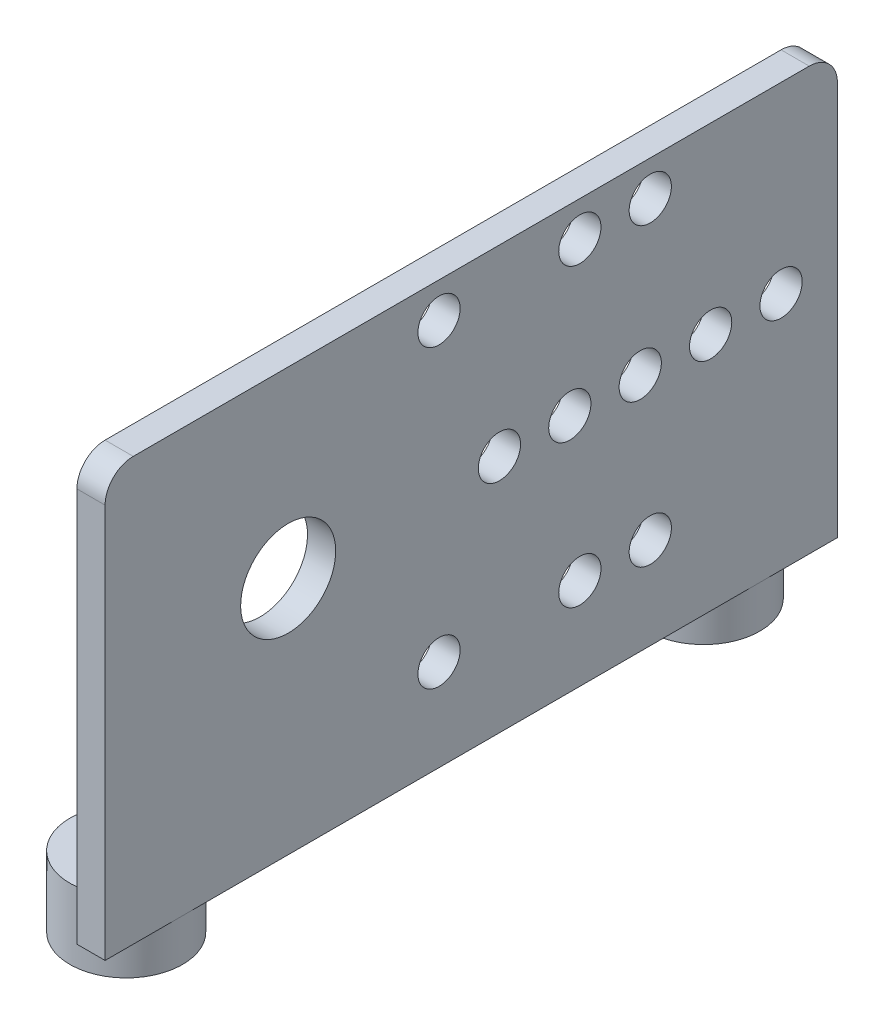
ISO-10303-21;
HEADER;
FILE_DESCRIPTION(('STEP AP214'),'2;1');
FILE_NAME('part.step','',(''),(''),'','','');
FILE_SCHEMA(('AUTOMOTIVE_DESIGN { 1 0 10303 214 1 1 1 1 }'));
ENDSEC;
DATA;
#1=APPLICATION_CONTEXT('core data for automotive mechanical design processes');
#2=APPLICATION_PROTOCOL_DEFINITION('international standard','automotive_design',2000,#1);
#3=PRODUCT_CONTEXT('',#1,'mechanical');
#4=PRODUCT('Part','Part','',(#3));
#5=PRODUCT_RELATED_PRODUCT_CATEGORY('part','',(#4));
#6=PRODUCT_DEFINITION_FORMATION('','',#4);
#7=PRODUCT_DEFINITION_CONTEXT('part definition',#1,'design');
#8=PRODUCT_DEFINITION('design','',#6,#7);
#9=PRODUCT_DEFINITION_SHAPE('','',#8);
#10=(LENGTH_UNIT() NAMED_UNIT(*) SI_UNIT(.MILLI.,.METRE.));
#11=(NAMED_UNIT(*) PLANE_ANGLE_UNIT() SI_UNIT($,.RADIAN.));
#12=(NAMED_UNIT(*) SI_UNIT($,.STERADIAN.) SOLID_ANGLE_UNIT());
#13=UNCERTAINTY_MEASURE_WITH_UNIT(LENGTH_MEASURE(1.E-05),#10,'distance_accuracy_value','');
#14=(GEOMETRIC_REPRESENTATION_CONTEXT(3) GLOBAL_UNCERTAINTY_ASSIGNED_CONTEXT((#13)) GLOBAL_UNIT_ASSIGNED_CONTEXT((#10,
#11,#12)) REPRESENTATION_CONTEXT('',''));
#15=CARTESIAN_POINT('',(0.,0.,0.));
#16=DIRECTION('',(0.,0.,1.));
#17=DIRECTION('',(1.,0.,0.));
#18=AXIS2_PLACEMENT_3D('',#15,#16,#17);
#19=CARTESIAN_POINT('',(0.,0.,-52.));
#20=DIRECTION('',(0.,1.,0.));
#21=DIRECTION('',(0.,0.,-1.));
#22=AXIS2_PLACEMENT_3D('',#19,#20,#21);
#23=PLANE('',#22);
#24=DIRECTION('',(0.,0.,1.));
#25=VECTOR('',#24,1.);
#26=CARTESIAN_POINT('',(0.,0.,-52.));
#27=LINE('',#26,#25);
#28=CARTESIAN_POINT('',(0.,0.,-43.0358983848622));
#29=VERTEX_POINT('',#28);
#30=CARTESIAN_POINT('',(0.,0.,-8.96410161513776));
#31=VERTEX_POINT('',#30);
#32=EDGE_CURVE('E261',#29,#31,#27,.T.);
#33=ORIENTED_EDGE('',*,*,#32,.F.);
#34=CARTESIAN_POINT('',(-2.,0.,-46.5));
#35=DIRECTION('',(0.,1.,0.));
#36=DIRECTION('',(0.,0.,1.));
#37=AXIS2_PLACEMENT_3D('',#34,#35,#36);
#38=CIRCLE('',#37,4.);
#39=CARTESIAN_POINT('',(2.,0.,-46.5));
#40=VERTEX_POINT('',#39);
#41=EDGE_CURVE('E120',#29,#40,#38,.T.);
#42=ORIENTED_EDGE('',*,*,#41,.T.);
#43=DIRECTION('',(0.,0.,1.));
#44=VECTOR('',#43,1.);
#45=CARTESIAN_POINT('',(2.,0.,-52.));
#46=LINE('',#45,#44);
#47=CARTESIAN_POINT('',(2.,0.,-5.50000000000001));
#48=VERTEX_POINT('',#47);
#49=EDGE_CURVE('E167',#40,#48,#46,.T.);
#50=ORIENTED_EDGE('',*,*,#49,.T.);
#51=CARTESIAN_POINT('',(-2.,0.,-5.5));
#52=DIRECTION('',(0.,1.,0.));
#53=DIRECTION('',(0.,0.,1.));
#54=AXIS2_PLACEMENT_3D('',#51,#52,#53);
#55=CIRCLE('',#54,4.);
#56=EDGE_CURVE('E158',#31,#48,#55,.F.);
#57=ORIENTED_EDGE('',*,*,#56,.F.);
#58=EDGE_LOOP('',(#33,#42,#50,#57));
#59=FACE_BOUND('',#58,.T.);
#60=ADVANCED_FACE('F33',(#59),#23,.F.);
#61=CARTESIAN_POINT('',(0.,30.,-52.));
#62=DIRECTION('',(1.,0.,0.));
#63=DIRECTION('',(0.,1.,0.));
#64=AXIS2_PLACEMENT_3D('',#61,#62,#63);
#65=PLANE('',#64);
#66=CARTESIAN_POINT('',(0.,17.,-13.));
#67=DIRECTION('',(1.,0.,0.));
#68=DIRECTION('',(0.,1.,0.));
#69=AXIS2_PLACEMENT_3D('',#66,#67,#68);
#70=CIRCLE('',#69,3.375);
#71=CARTESIAN_POINT('',(0.,20.375,-13.));
#72=VERTEX_POINT('',#71);
#73=EDGE_CURVE('E567',#72,#72,#70,.T.);
#74=ORIENTED_EDGE('',*,*,#73,.T.);
#75=EDGE_LOOP('',(#74));
#76=FACE_BOUND('',#75,.T.);
#77=CARTESIAN_POINT('',(0.,0.,-52.));
#78=VERTEX_POINT('',#77);
#79=CARTESIAN_POINT('',(0.,0.,-49.9641016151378));
#80=VERTEX_POINT('',#79);
#81=EDGE_CURVE('E258',#78,#80,#27,.T.);
#82=ORIENTED_EDGE('',*,*,#81,.T.);
#83=DIRECTION('',(0.,1.,0.));
#84=VECTOR('',#83,1.);
#85=CARTESIAN_POINT('',(0.,-3.,-49.9641016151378));
#86=LINE('',#85,#84);
#87=CARTESIAN_POINT('',(0.,2.,-49.9641016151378));
#88=VERTEX_POINT('',#87);
#89=EDGE_CURVE('E49',#80,#88,#86,.T.);
#90=ORIENTED_EDGE('',*,*,#89,.T.);
#91=DIRECTION('',(0.,0.,-1.));
#92=VECTOR('',#91,1.);
#93=CARTESIAN_POINT('',(0.,2.,-52.));
#94=LINE('',#93,#92);
#95=CARTESIAN_POINT('',(0.,2.,-43.0358983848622));
#96=VERTEX_POINT('',#95);
#97=EDGE_CURVE('E127',#96,#88,#94,.T.);
#98=ORIENTED_EDGE('',*,*,#97,.F.);
#99=DIRECTION('',(0.,1.,0.));
#100=VECTOR('',#99,1.);
#101=CARTESIAN_POINT('',(0.,-3.,-43.0358983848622));
#102=LINE('',#101,#100);
#103=EDGE_CURVE('E115',#96,#29,#102,.F.);
#104=ORIENTED_EDGE('',*,*,#103,.T.);
#105=ORIENTED_EDGE('',*,*,#32,.T.);
#106=DIRECTION('',(0.,1.,0.));
#107=VECTOR('',#106,1.);
#108=CARTESIAN_POINT('',(0.,-3.,-8.96410161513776));
#109=LINE('',#108,#107);
#110=CARTESIAN_POINT('',(0.,2.,-8.96410161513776));
#111=VERTEX_POINT('',#110);
#112=EDGE_CURVE('E57',#111,#31,#109,.F.);
#113=ORIENTED_EDGE('',*,*,#112,.F.);
#114=DIRECTION('',(0.,0.,-1.));
#115=VECTOR('',#114,1.);
#116=CARTESIAN_POINT('',(0.,2.,-52.));
#117=LINE('',#116,#115);
#118=CARTESIAN_POINT('',(0.,2.,-2.03589838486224));
#119=VERTEX_POINT('',#118);
#120=EDGE_CURVE('E150',#119,#111,#117,.T.);
#121=ORIENTED_EDGE('',*,*,#120,.F.);
#122=DIRECTION('',(0.,1.,0.));
#123=VECTOR('',#122,1.);
#124=CARTESIAN_POINT('',(0.,-3.,-2.03589838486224));
#125=LINE('',#124,#123);
#126=CARTESIAN_POINT('',(0.,0.,-2.03589838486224));
#127=VERTEX_POINT('',#126);
#128=EDGE_CURVE('E157',#127,#119,#125,.T.);
#129=ORIENTED_EDGE('',*,*,#128,.F.);
#130=CARTESIAN_POINT('',(0.,0.,0.));
#131=VERTEX_POINT('',#130);
#132=EDGE_CURVE('E257',#127,#131,#27,.T.);
#133=ORIENTED_EDGE('',*,*,#132,.T.);
#134=DIRECTION('',(0.,-1.,0.));
#135=VECTOR('',#134,1.);
#136=CARTESIAN_POINT('',(0.,30.,0.));
#137=LINE('',#136,#135);
#138=CARTESIAN_POINT('',(0.,28.,0.));
#139=VERTEX_POINT('',#138);
#140=EDGE_CURVE('E233',#139,#131,#137,.T.);
#141=ORIENTED_EDGE('',*,*,#140,.F.);
#142=CARTESIAN_POINT('',(0.,28.,-2.));
#143=DIRECTION('',(-1.,0.,0.));
#144=DIRECTION('',(0.,1.,0.));
#145=AXIS2_PLACEMENT_3D('',#142,#143,#144);
#146=CIRCLE('',#145,2.);
#147=CARTESIAN_POINT('',(0.,30.,-2.00000000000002));
#148=VERTEX_POINT('',#147);
#149=EDGE_CURVE('E268',#148,#139,#146,.F.);
#150=ORIENTED_EDGE('',*,*,#149,.F.);
#151=DIRECTION('',(0.,0.,1.));
#152=VECTOR('',#151,1.);
#153=CARTESIAN_POINT('',(0.,30.,-52.));
#154=LINE('',#153,#152);
#155=CARTESIAN_POINT('',(0.,30.,-50.));
#156=VERTEX_POINT('',#155);
#157=EDGE_CURVE('E244',#156,#148,#154,.T.);
#158=ORIENTED_EDGE('',*,*,#157,.F.);
#159=CARTESIAN_POINT('',(0.,28.,-50.));
#160=DIRECTION('',(-1.,0.,0.));
#161=DIRECTION('',(0.,1.,0.));
#162=AXIS2_PLACEMENT_3D('',#159,#160,#161);
#163=CIRCLE('',#162,2.);
#164=CARTESIAN_POINT('',(0.,28.,-52.));
#165=VERTEX_POINT('',#164);
#166=EDGE_CURVE('E265',#165,#156,#163,.F.);
#167=ORIENTED_EDGE('',*,*,#166,.F.);
#168=DIRECTION('',(0.,-1.,0.));
#169=VECTOR('',#168,1.);
#170=CARTESIAN_POINT('',(0.,30.,-52.));
#171=LINE('',#170,#169);
#172=EDGE_CURVE('E234',#165,#78,#171,.T.);
#173=ORIENTED_EDGE('',*,*,#172,.T.);
#174=EDGE_LOOP('',(#82,#90,#98,#104,#105,#113,#121,#129,#133,#141,#150,#158,#167,#173));
#175=FACE_BOUND('',#174,.T.);
#176=CARTESIAN_POINT('',(0.,17.,-43.));
#177=DIRECTION('',(-1.,0.,0.));
#178=DIRECTION('',(0.,1.,0.));
#179=AXIS2_PLACEMENT_3D('',#176,#177,#178);
#180=CIRCLE('',#179,1.5);
#181=CARTESIAN_POINT('',(0.,18.5,-43.));
#182=VERTEX_POINT('',#181);
#183=EDGE_CURVE('E230',#182,#182,#180,.F.);
#184=ORIENTED_EDGE('',*,*,#183,.T.);
#185=EDGE_LOOP('',(#184));
#186=FACE_BOUND('',#185,.T.);
#187=CARTESIAN_POINT('',(0.,17.,-38.));
#188=DIRECTION('',(-1.,0.,0.));
#189=DIRECTION('',(0.,1.,0.));
#190=AXIS2_PLACEMENT_3D('',#187,#188,#189);
#191=CIRCLE('',#190,1.5);
#192=CARTESIAN_POINT('',(0.,18.5,-38.));
#193=VERTEX_POINT('',#192);
#194=EDGE_CURVE('E212',#193,#193,#191,.F.);
#195=ORIENTED_EDGE('',*,*,#194,.T.);
#196=EDGE_LOOP('',(#195));
#197=FACE_BOUND('',#196,.T.);
#198=CARTESIAN_POINT('',(0.,17.,-28.));
#199=DIRECTION('',(-1.,0.,0.));
#200=DIRECTION('',(0.,1.,0.));
#201=AXIS2_PLACEMENT_3D('',#198,#199,#200);
#202=CIRCLE('',#201,1.5);
#203=CARTESIAN_POINT('',(0.,18.5,-28.));
#204=VERTEX_POINT('',#203);
#205=EDGE_CURVE('E201',#204,#204,#202,.F.);
#206=ORIENTED_EDGE('',*,*,#205,.T.);
#207=EDGE_LOOP('',(#206));
#208=FACE_BOUND('',#207,.T.);
#209=CARTESIAN_POINT('',(0.,27.5,-38.7121426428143));
#210=DIRECTION('',(-1.,0.,0.));
#211=DIRECTION('',(0.,1.,0.));
#212=AXIS2_PLACEMENT_3D('',#209,#210,#211);
#213=CIRCLE('',#212,1.5);
#214=CARTESIAN_POINT('',(0.,29.,-38.7121426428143));
#215=VERTEX_POINT('',#214);
#216=EDGE_CURVE('E202',#215,#215,#213,.F.);
#217=ORIENTED_EDGE('',*,*,#216,.T.);
#218=EDGE_LOOP('',(#217));
#219=FACE_BOUND('',#218,.T.);
#220=CARTESIAN_POINT('',(0.,17.,-48.));
#221=DIRECTION('',(-1.,0.,0.));
#222=DIRECTION('',(0.,1.,0.));
#223=AXIS2_PLACEMENT_3D('',#220,#221,#222);
#224=CIRCLE('',#223,1.5);
#225=CARTESIAN_POINT('',(0.,18.5,-48.));
#226=VERTEX_POINT('',#225);
#227=EDGE_CURVE('E220',#226,#226,#224,.F.);
#228=ORIENTED_EDGE('',*,*,#227,.T.);
#229=EDGE_LOOP('',(#228));
#230=FACE_BOUND('',#229,.T.);
#231=CARTESIAN_POINT('',(0.,17.,-33.));
#232=DIRECTION('',(-1.,0.,0.));
#233=DIRECTION('',(0.,1.,0.));
#234=AXIS2_PLACEMENT_3D('',#231,#232,#233);
#235=CIRCLE('',#234,1.5);
#236=CARTESIAN_POINT('',(0.,18.5,-33.));
#237=VERTEX_POINT('',#236);
#238=EDGE_CURVE('E219',#237,#237,#235,.F.);
#239=ORIENTED_EDGE('',*,*,#238,.T.);
#240=EDGE_LOOP('',(#239));
#241=FACE_BOUND('',#240,.T.);
#242=CARTESIAN_POINT('',(0.,6.50000000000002,-23.7121426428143));
#243=DIRECTION('',(-1.,0.,0.));
#244=DIRECTION('',(0.,1.,0.));
#245=AXIS2_PLACEMENT_3D('',#242,#243,#244);
#246=CIRCLE('',#245,1.5);
#247=CARTESIAN_POINT('',(0.,8.00000000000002,-23.7121426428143));
#248=VERTEX_POINT('',#247);
#249=EDGE_CURVE('E179',#248,#248,#246,.F.);
#250=ORIENTED_EDGE('',*,*,#249,.T.);
#251=EDGE_LOOP('',(#250));
#252=FACE_BOUND('',#251,.T.);
#253=CARTESIAN_POINT('',(0.,27.5,-23.7121426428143));
#254=DIRECTION('',(-1.,0.,0.));
#255=DIRECTION('',(0.,1.,0.));
#256=AXIS2_PLACEMENT_3D('',#253,#254,#255);
#257=CIRCLE('',#256,1.5);
#258=CARTESIAN_POINT('',(0.,29.,-23.7121426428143));
#259=VERTEX_POINT('',#258);
#260=EDGE_CURVE('E172',#259,#259,#257,.F.);
#261=ORIENTED_EDGE('',*,*,#260,.T.);
#262=EDGE_LOOP('',(#261));
#263=FACE_BOUND('',#262,.T.);
#264=CARTESIAN_POINT('',(0.,6.50000000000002,-38.7121426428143));
#265=DIRECTION('',(-1.,0.,0.));
#266=DIRECTION('',(0.,1.,0.));
#267=AXIS2_PLACEMENT_3D('',#264,#265,#266);
#268=CIRCLE('',#267,1.5);
#269=CARTESIAN_POINT('',(0.,8.00000000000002,-38.7121426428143));
#270=VERTEX_POINT('',#269);
#271=EDGE_CURVE('E171',#270,#270,#268,.F.);
#272=ORIENTED_EDGE('',*,*,#271,.T.);
#273=EDGE_LOOP('',(#272));
#274=FACE_BOUND('',#273,.T.);
#275=CARTESIAN_POINT('',(0.,6.50000000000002,-33.7121426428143));
#276=DIRECTION('',(-1.,0.,0.));
#277=DIRECTION('',(0.,1.,0.));
#278=AXIS2_PLACEMENT_3D('',#275,#276,#277);
#279=CIRCLE('',#278,1.5);
#280=CARTESIAN_POINT('',(0.,8.00000000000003,-33.7121426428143));
#281=VERTEX_POINT('',#280);
#282=EDGE_CURVE('E190',#281,#281,#279,.F.);
#283=ORIENTED_EDGE('',*,*,#282,.T.);
#284=EDGE_LOOP('',(#283));
#285=FACE_BOUND('',#284,.T.);
#286=CARTESIAN_POINT('',(0.,27.5,-33.7121426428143));
#287=DIRECTION('',(-1.,0.,0.));
#288=DIRECTION('',(0.,1.,0.));
#289=AXIS2_PLACEMENT_3D('',#286,#287,#288);
#290=CIRCLE('',#289,1.5);
#291=CARTESIAN_POINT('',(0.,29.,-33.7121426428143));
#292=VERTEX_POINT('',#291);
#293=EDGE_CURVE('E189',#292,#292,#290,.F.);
#294=ORIENTED_EDGE('',*,*,#293,.T.);
#295=EDGE_LOOP('',(#294));
#296=FACE_BOUND('',#295,.T.);
#297=ADVANCED_FACE('F132',(#76,#175,#186,#197,#208,#219,#230,#241,#252,#263,#274,#285,#296),#65,.F.);
#298=CARTESIAN_POINT('',(2.,0.,-52.));
#299=VERTEX_POINT('',#298);
#300=EDGE_CURVE('E163',#299,#40,#46,.T.);
#301=ORIENTED_EDGE('',*,*,#300,.T.);
#302=EDGE_CURVE('E134',#40,#80,#38,.T.);
#303=ORIENTED_EDGE('',*,*,#302,.T.);
#304=ORIENTED_EDGE('',*,*,#81,.F.);
#305=DIRECTION('',(1.,0.,0.));
#306=VECTOR('',#305,1.);
#307=CARTESIAN_POINT('',(0.,0.,-52.));
#308=LINE('',#307,#306);
#309=EDGE_CURVE('E237',#78,#299,#308,.T.);
#310=ORIENTED_EDGE('',*,*,#309,.T.);
#311=EDGE_LOOP('',(#301,#303,#304,#310));
#312=FACE_BOUND('',#311,.T.);
#313=ADVANCED_FACE('F325',(#312),#23,.F.);
#314=EDGE_CURVE('E154',#48,#127,#55,.F.);
#315=ORIENTED_EDGE('',*,*,#314,.F.);
#316=CARTESIAN_POINT('',(2.,0.,0.));
#317=VERTEX_POINT('',#316);
#318=EDGE_CURVE('E162',#48,#317,#46,.T.);
#319=ORIENTED_EDGE('',*,*,#318,.T.);
#320=DIRECTION('',(1.,0.,0.));
#321=VECTOR('',#320,1.);
#322=CARTESIAN_POINT('',(0.,0.,0.));
#323=LINE('',#322,#321);
#324=EDGE_CURVE('E247',#131,#317,#323,.T.);
#325=ORIENTED_EDGE('',*,*,#324,.F.);
#326=ORIENTED_EDGE('',*,*,#132,.F.);
#327=EDGE_LOOP('',(#315,#319,#325,#326));
#328=FACE_BOUND('',#327,.T.);
#329=ADVANCED_FACE('F306',(#328),#23,.F.);
#330=CARTESIAN_POINT('',(2.,3.,-52.));
#331=DIRECTION('',(-1.,0.,0.));
#332=DIRECTION('',(0.,-1.,0.));
#333=AXIS2_PLACEMENT_3D('',#330,#331,#332);
#334=PLANE('',#333);
#335=CARTESIAN_POINT('',(2.,17.,-13.));
#336=DIRECTION('',(-1.,0.,0.));
#337=DIRECTION('',(0.,-1.,0.));
#338=AXIS2_PLACEMENT_3D('',#335,#336,#337);
#339=CIRCLE('',#338,3.375);
#340=CARTESIAN_POINT('',(2.,20.375,-13.));
#341=VERTEX_POINT('',#340);
#342=EDGE_CURVE('E37',#341,#341,#339,.T.);
#343=ORIENTED_EDGE('',*,*,#342,.T.);
#344=EDGE_LOOP('',(#343));
#345=FACE_BOUND('',#344,.T.);
#346=ORIENTED_EDGE('',*,*,#318,.F.);
#347=ORIENTED_EDGE('',*,*,#49,.F.);
#348=ORIENTED_EDGE('',*,*,#300,.F.);
#349=DIRECTION('',(0.,1.,0.));
#350=VECTOR('',#349,1.);
#351=CARTESIAN_POINT('',(2.,3.,-52.));
#352=LINE('',#351,#350);
#353=CARTESIAN_POINT('',(2.,28.,-52.));
#354=VERTEX_POINT('',#353);
#355=EDGE_CURVE('E241',#299,#354,#352,.T.);
#356=ORIENTED_EDGE('',*,*,#355,.T.);
#357=CARTESIAN_POINT('',(2.,28.,-50.));
#358=DIRECTION('',(1.,0.,0.));
#359=DIRECTION('',(0.,-1.,0.));
#360=AXIS2_PLACEMENT_3D('',#357,#358,#359);
#361=CIRCLE('',#360,2.);
#362=CARTESIAN_POINT('',(2.,30.,-50.));
#363=VERTEX_POINT('',#362);
#364=EDGE_CURVE('E273',#363,#354,#361,.F.);
#365=ORIENTED_EDGE('',*,*,#364,.F.);
#366=DIRECTION('',(0.,0.,1.));
#367=VECTOR('',#366,1.);
#368=CARTESIAN_POINT('',(2.,30.,-52.));
#369=LINE('',#368,#367);
#370=CARTESIAN_POINT('',(2.,30.,-2.00000000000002));
#371=VERTEX_POINT('',#370);
#372=EDGE_CURVE('E254',#363,#371,#369,.T.);
#373=ORIENTED_EDGE('',*,*,#372,.T.);
#374=CARTESIAN_POINT('',(2.,28.,-2.));
#375=DIRECTION('',(1.,0.,0.));
#376=DIRECTION('',(0.,-1.,0.));
#377=AXIS2_PLACEMENT_3D('',#374,#375,#376);
#378=CIRCLE('',#377,2.);
#379=CARTESIAN_POINT('',(2.,28.,0.));
#380=VERTEX_POINT('',#379);
#381=EDGE_CURVE('E42',#380,#371,#378,.F.);
#382=ORIENTED_EDGE('',*,*,#381,.F.);
#383=DIRECTION('',(0.,1.,0.));
#384=VECTOR('',#383,1.);
#385=CARTESIAN_POINT('',(2.,3.,0.));
#386=LINE('',#385,#384);
#387=EDGE_CURVE('E238',#317,#380,#386,.T.);
#388=ORIENTED_EDGE('',*,*,#387,.F.);
#389=EDGE_LOOP('',(#346,#347,#348,#356,#365,#373,#382,#388));
#390=FACE_BOUND('',#389,.T.);
#391=CARTESIAN_POINT('',(2.,27.5,-33.7121426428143));
#392=DIRECTION('',(-1.,0.,0.));
#393=DIRECTION('',(0.,1.,0.));
#394=AXIS2_PLACEMENT_3D('',#391,#392,#393);
#395=CIRCLE('',#394,1.5);
#396=CARTESIAN_POINT('',(2.,29.,-33.7121426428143));
#397=VERTEX_POINT('',#396);
#398=EDGE_CURVE('E186',#397,#397,#395,.T.);
#399=ORIENTED_EDGE('',*,*,#398,.T.);
#400=EDGE_LOOP('',(#399));
#401=FACE_BOUND('',#400,.T.);
#402=CARTESIAN_POINT('',(2.,6.50000000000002,-33.7121426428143));
#403=DIRECTION('',(-1.,0.,0.));
#404=DIRECTION('',(0.,-1.,0.));
#405=AXIS2_PLACEMENT_3D('',#402,#403,#404);
#406=CIRCLE('',#405,1.5);
#407=CARTESIAN_POINT('',(2.,5.00000000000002,-33.7121426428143));
#408=VERTEX_POINT('',#407);
#409=EDGE_CURVE('E175',#408,#408,#406,.T.);
#410=ORIENTED_EDGE('',*,*,#409,.T.);
#411=EDGE_LOOP('',(#410));
#412=FACE_BOUND('',#411,.T.);
#413=CARTESIAN_POINT('',(2.,6.50000000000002,-38.7121426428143));
#414=DIRECTION('',(-1.,0.,0.));
#415=DIRECTION('',(0.,-1.,0.));
#416=AXIS2_PLACEMENT_3D('',#413,#414,#415);
#417=CIRCLE('',#416,1.5);
#418=CARTESIAN_POINT('',(2.,5.00000000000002,-38.7121426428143));
#419=VERTEX_POINT('',#418);
#420=EDGE_CURVE('E168',#419,#419,#417,.T.);
#421=ORIENTED_EDGE('',*,*,#420,.T.);
#422=EDGE_LOOP('',(#421));
#423=FACE_BOUND('',#422,.T.);
#424=CARTESIAN_POINT('',(2.,27.5,-23.7121426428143));
#425=DIRECTION('',(-1.,0.,0.));
#426=DIRECTION('',(0.,-1.,0.));
#427=AXIS2_PLACEMENT_3D('',#424,#425,#426);
#428=CIRCLE('',#427,1.5);
#429=CARTESIAN_POINT('',(2.,26.,-23.7121426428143));
#430=VERTEX_POINT('',#429);
#431=EDGE_CURVE('E176',#430,#430,#428,.T.);
#432=ORIENTED_EDGE('',*,*,#431,.T.);
#433=EDGE_LOOP('',(#432));
#434=FACE_BOUND('',#433,.T.);
#435=CARTESIAN_POINT('',(2.,6.50000000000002,-23.7121426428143));
#436=DIRECTION('',(-1.,0.,0.));
#437=DIRECTION('',(0.,1.,0.));
#438=AXIS2_PLACEMENT_3D('',#435,#436,#437);
#439=CIRCLE('',#438,1.5);
#440=CARTESIAN_POINT('',(2.,8.00000000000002,-23.7121426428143));
#441=VERTEX_POINT('',#440);
#442=EDGE_CURVE('E166',#441,#441,#439,.T.);
#443=ORIENTED_EDGE('',*,*,#442,.T.);
#444=EDGE_LOOP('',(#443));
#445=FACE_BOUND('',#444,.T.);
#446=CARTESIAN_POINT('',(2.,17.,-33.));
#447=DIRECTION('',(-1.,0.,0.));
#448=DIRECTION('',(0.,1.,0.));
#449=AXIS2_PLACEMENT_3D('',#446,#447,#448);
#450=CIRCLE('',#449,1.5);
#451=CARTESIAN_POINT('',(2.,18.5,-33.));
#452=VERTEX_POINT('',#451);
#453=EDGE_CURVE('E216',#452,#452,#450,.T.);
#454=ORIENTED_EDGE('',*,*,#453,.T.);
#455=EDGE_LOOP('',(#454));
#456=FACE_BOUND('',#455,.T.);
#457=CARTESIAN_POINT('',(2.,17.,-48.));
#458=DIRECTION('',(-1.,0.,0.));
#459=DIRECTION('',(0.,1.,0.));
#460=AXIS2_PLACEMENT_3D('',#457,#458,#459);
#461=CIRCLE('',#460,1.5);
#462=CARTESIAN_POINT('',(2.,18.5,-48.));
#463=VERTEX_POINT('',#462);
#464=EDGE_CURVE('E215',#463,#463,#461,.T.);
#465=ORIENTED_EDGE('',*,*,#464,.T.);
#466=EDGE_LOOP('',(#465));
#467=FACE_BOUND('',#466,.T.);
#468=CARTESIAN_POINT('',(2.,27.5,-38.7121426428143));
#469=DIRECTION('',(-1.,0.,0.));
#470=DIRECTION('',(0.,1.,0.));
#471=AXIS2_PLACEMENT_3D('',#468,#469,#470);
#472=CIRCLE('',#471,1.5);
#473=CARTESIAN_POINT('',(2.,29.,-38.7121426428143));
#474=VERTEX_POINT('',#473);
#475=EDGE_CURVE('E193',#474,#474,#472,.T.);
#476=ORIENTED_EDGE('',*,*,#475,.T.);
#477=EDGE_LOOP('',(#476));
#478=FACE_BOUND('',#477,.T.);
#479=CARTESIAN_POINT('',(2.,17.,-28.));
#480=DIRECTION('',(-1.,0.,0.));
#481=DIRECTION('',(0.,1.,0.));
#482=AXIS2_PLACEMENT_3D('',#479,#480,#481);
#483=CIRCLE('',#482,1.5);
#484=CARTESIAN_POINT('',(2.,18.5,-28.));
#485=VERTEX_POINT('',#484);
#486=EDGE_CURVE('E198',#485,#485,#483,.T.);
#487=ORIENTED_EDGE('',*,*,#486,.T.);
#488=EDGE_LOOP('',(#487));
#489=FACE_BOUND('',#488,.T.);
#490=CARTESIAN_POINT('',(2.,17.,-38.));
#491=DIRECTION('',(-1.,0.,0.));
#492=DIRECTION('',(0.,1.,0.));
#493=AXIS2_PLACEMENT_3D('',#490,#491,#492);
#494=CIRCLE('',#493,1.5);
#495=CARTESIAN_POINT('',(2.,18.5,-38.));
#496=VERTEX_POINT('',#495);
#497=EDGE_CURVE('E205',#496,#496,#494,.T.);
#498=ORIENTED_EDGE('',*,*,#497,.T.);
#499=EDGE_LOOP('',(#498));
#500=FACE_BOUND('',#499,.T.);
#501=CARTESIAN_POINT('',(2.,17.,-43.));
#502=DIRECTION('',(-1.,0.,0.));
#503=DIRECTION('',(0.,1.,0.));
#504=AXIS2_PLACEMENT_3D('',#501,#502,#503);
#505=CIRCLE('',#504,1.5);
#506=CARTESIAN_POINT('',(2.,18.5,-43.));
#507=VERTEX_POINT('',#506);
#508=EDGE_CURVE('E223',#507,#507,#505,.T.);
#509=ORIENTED_EDGE('',*,*,#508,.T.);
#510=EDGE_LOOP('',(#509));
#511=FACE_BOUND('',#510,.T.);
#512=ADVANCED_FACE('F286',(#345,#390,#401,#412,#423,#434,#445,#456,#467,#478,#489,#500,#511),
#334,.F.);
#513=CARTESIAN_POINT('',(2.,30.,-52.));
#514=DIRECTION('',(0.,-1.,0.));
#515=DIRECTION('',(0.,0.,1.));
#516=AXIS2_PLACEMENT_3D('',#513,#514,#515);
#517=PLANE('',#516);
#518=ORIENTED_EDGE('',*,*,#372,.F.);
#519=DIRECTION('',(-1.,0.,0.));
#520=VECTOR('',#519,1.);
#521=CARTESIAN_POINT('',(2.,30.,-50.));
#522=LINE('',#521,#520);
#523=EDGE_CURVE('E260',#156,#363,#522,.F.);
#524=ORIENTED_EDGE('',*,*,#523,.F.);
#525=ORIENTED_EDGE('',*,*,#157,.T.);
#526=DIRECTION('',(-1.,0.,0.));
#527=VECTOR('',#526,1.);
#528=CARTESIAN_POINT('',(2.,30.,-2.));
#529=LINE('',#528,#527);
#530=EDGE_CURVE('E263',#371,#148,#529,.T.);
#531=ORIENTED_EDGE('',*,*,#530,.F.);
#532=EDGE_LOOP('',(#518,#524,#525,#531));
#533=FACE_BOUND('',#532,.T.);
#534=ADVANCED_FACE('F289',(#533),#517,.F.);
#535=CARTESIAN_POINT('',(0.,0.,-52.));
#536=DIRECTION('',(0.,0.,-1.));
#537=DIRECTION('',(1.,0.,0.));
#538=AXIS2_PLACEMENT_3D('',#535,#536,#537);
#539=PLANE('',#538);
#540=ORIENTED_EDGE('',*,*,#355,.F.);
#541=ORIENTED_EDGE('',*,*,#309,.F.);
#542=ORIENTED_EDGE('',*,*,#172,.F.);
#543=DIRECTION('',(-1.,0.,0.));
#544=VECTOR('',#543,1.);
#545=CARTESIAN_POINT('',(0.,28.,-52.));
#546=LINE('',#545,#544);
#547=EDGE_CURVE('E11',#354,#165,#546,.T.);
#548=ORIENTED_EDGE('',*,*,#547,.F.);
#549=EDGE_LOOP('',(#540,#541,#542,#548));
#550=FACE_BOUND('',#549,.T.);
#551=ADVANCED_FACE('F342',(#550),#539,.T.);
#552=CARTESIAN_POINT('',(0.,0.,0.));
#553=DIRECTION('',(0.,0.,-1.));
#554=DIRECTION('',(1.,0.,0.));
#555=AXIS2_PLACEMENT_3D('',#552,#553,#554);
#556=PLANE('',#555);
#557=ORIENTED_EDGE('',*,*,#324,.T.);
#558=ORIENTED_EDGE('',*,*,#387,.T.);
#559=DIRECTION('',(-1.,0.,0.));
#560=VECTOR('',#559,1.);
#561=CARTESIAN_POINT('',(0.,28.,0.));
#562=LINE('',#561,#560);
#563=EDGE_CURVE('E271',#139,#380,#562,.F.);
#564=ORIENTED_EDGE('',*,*,#563,.F.);
#565=ORIENTED_EDGE('',*,*,#140,.T.);
#566=EDGE_LOOP('',(#557,#558,#564,#565));
#567=FACE_BOUND('',#566,.T.);
#568=ADVANCED_FACE('F296',(#567),#556,.F.);
#569=CARTESIAN_POINT('',(2.,28.,-2.));
#570=DIRECTION('',(-1.,0.,0.));
#571=DIRECTION('',(0.,0.,-1.));
#572=AXIS2_PLACEMENT_3D('',#569,#570,#571);
#573=CYLINDRICAL_SURFACE('',#572,2.);
#574=ORIENTED_EDGE('',*,*,#381,.T.);
#575=ORIENTED_EDGE('',*,*,#530,.T.);
#576=ORIENTED_EDGE('',*,*,#149,.T.);
#577=ORIENTED_EDGE('',*,*,#563,.T.);
#578=EDGE_LOOP('',(#574,#575,#576,#577));
#579=FACE_BOUND('',#578,.T.);
#580=ADVANCED_FACE('F279',(#579),#573,.T.);
#581=CARTESIAN_POINT('',(0.,28.,-50.));
#582=DIRECTION('',(1.,0.,0.));
#583=DIRECTION('',(0.,0.,1.));
#584=AXIS2_PLACEMENT_3D('',#581,#582,#583);
#585=CYLINDRICAL_SURFACE('',#584,2.);
#586=ORIENTED_EDGE('',*,*,#364,.T.);
#587=ORIENTED_EDGE('',*,*,#547,.T.);
#588=ORIENTED_EDGE('',*,*,#166,.T.);
#589=ORIENTED_EDGE('',*,*,#523,.T.);
#590=EDGE_LOOP('',(#586,#587,#588,#589));
#591=FACE_BOUND('',#590,.T.);
#592=ADVANCED_FACE('F35',(#591),#585,.T.);
#593=CARTESIAN_POINT('',(-4.24264068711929,17.,-43.));
#594=DIRECTION('',(1.,0.,0.));
#595=DIRECTION('',(0.,1.,0.));
#596=AXIS2_PLACEMENT_3D('',#593,#594,#595);
#597=CYLINDRICAL_SURFACE('',#596,1.5);
#598=ORIENTED_EDGE('',*,*,#183,.F.);
#599=EDGE_LOOP('',(#598));
#600=FACE_BOUND('',#599,.T.);
#601=ORIENTED_EDGE('',*,*,#508,.F.);
#602=EDGE_LOOP('',(#601));
#603=FACE_BOUND('',#602,.T.);
#604=ADVANCED_FACE('F351',(#600,#603),#597,.F.);
#605=CARTESIAN_POINT('',(-4.24264068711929,17.,-38.));
#606=DIRECTION('',(1.,0.,0.));
#607=DIRECTION('',(0.,1.,0.));
#608=AXIS2_PLACEMENT_3D('',#605,#606,#607);
#609=CYLINDRICAL_SURFACE('',#608,1.5);
#610=ORIENTED_EDGE('',*,*,#194,.F.);
#611=EDGE_LOOP('',(#610));
#612=FACE_BOUND('',#611,.T.);
#613=ORIENTED_EDGE('',*,*,#497,.F.);
#614=EDGE_LOOP('',(#613));
#615=FACE_BOUND('',#614,.T.);
#616=ADVANCED_FACE('F354',(#612,#615),#609,.F.);
#617=CARTESIAN_POINT('',(-4.24264068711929,17.,-28.));
#618=DIRECTION('',(1.,0.,0.));
#619=DIRECTION('',(0.,1.,0.));
#620=AXIS2_PLACEMENT_3D('',#617,#618,#619);
#621=CYLINDRICAL_SURFACE('',#620,1.5);
#622=ORIENTED_EDGE('',*,*,#205,.F.);
#623=EDGE_LOOP('',(#622));
#624=FACE_BOUND('',#623,.T.);
#625=ORIENTED_EDGE('',*,*,#486,.F.);
#626=EDGE_LOOP('',(#625));
#627=FACE_BOUND('',#626,.T.);
#628=ADVANCED_FACE('F368',(#624,#627),#621,.F.);
#629=CARTESIAN_POINT('',(-4.24264068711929,27.5,-38.7121426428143));
#630=DIRECTION('',(1.,0.,0.));
#631=DIRECTION('',(0.,1.,0.));
#632=AXIS2_PLACEMENT_3D('',#629,#630,#631);
#633=CYLINDRICAL_SURFACE('',#632,1.5);
#634=ORIENTED_EDGE('',*,*,#216,.F.);
#635=EDGE_LOOP('',(#634));
#636=FACE_BOUND('',#635,.T.);
#637=ORIENTED_EDGE('',*,*,#475,.F.);
#638=EDGE_LOOP('',(#637));
#639=FACE_BOUND('',#638,.T.);
#640=ADVANCED_FACE('F360',(#636,#639),#633,.F.);
#641=CARTESIAN_POINT('',(-4.24264068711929,17.,-48.));
#642=DIRECTION('',(1.,0.,0.));
#643=DIRECTION('',(0.,1.,0.));
#644=AXIS2_PLACEMENT_3D('',#641,#642,#643);
#645=CYLINDRICAL_SURFACE('',#644,1.5);
#646=ORIENTED_EDGE('',*,*,#227,.F.);
#647=EDGE_LOOP('',(#646));
#648=FACE_BOUND('',#647,.T.);
#649=ORIENTED_EDGE('',*,*,#464,.F.);
#650=EDGE_LOOP('',(#649));
#651=FACE_BOUND('',#650,.T.);
#652=ADVANCED_FACE('F356',(#648,#651),#645,.F.);
#653=CARTESIAN_POINT('',(-4.24264068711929,17.,-33.));
#654=DIRECTION('',(1.,0.,0.));
#655=DIRECTION('',(0.,1.,0.));
#656=AXIS2_PLACEMENT_3D('',#653,#654,#655);
#657=CYLINDRICAL_SURFACE('',#656,1.5);
#658=ORIENTED_EDGE('',*,*,#238,.F.);
#659=EDGE_LOOP('',(#658));
#660=FACE_BOUND('',#659,.T.);
#661=ORIENTED_EDGE('',*,*,#453,.F.);
#662=EDGE_LOOP('',(#661));
#663=FACE_BOUND('',#662,.T.);
#664=ADVANCED_FACE('F359',(#660,#663),#657,.F.);
#665=CARTESIAN_POINT('',(-4.24264068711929,6.50000000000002,-23.7121426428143));
#666=DIRECTION('',(1.,0.,0.));
#667=DIRECTION('',(0.,1.,0.));
#668=AXIS2_PLACEMENT_3D('',#665,#666,#667);
#669=CYLINDRICAL_SURFACE('',#668,1.5);
#670=ORIENTED_EDGE('',*,*,#249,.F.);
#671=EDGE_LOOP('',(#670));
#672=FACE_BOUND('',#671,.T.);
#673=ORIENTED_EDGE('',*,*,#442,.F.);
#674=EDGE_LOOP('',(#673));
#675=FACE_BOUND('',#674,.T.);
#676=ADVANCED_FACE('F364',(#672,#675),#669,.F.);
#677=CARTESIAN_POINT('',(-4.24264068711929,27.5,-23.7121426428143));
#678=DIRECTION('',(1.,0.,0.));
#679=DIRECTION('',(0.,1.,0.));
#680=AXIS2_PLACEMENT_3D('',#677,#678,#679);
#681=CYLINDRICAL_SURFACE('',#680,1.5);
#682=ORIENTED_EDGE('',*,*,#260,.F.);
#683=EDGE_LOOP('',(#682));
#684=FACE_BOUND('',#683,.T.);
#685=ORIENTED_EDGE('',*,*,#431,.F.);
#686=EDGE_LOOP('',(#685));
#687=FACE_BOUND('',#686,.T.);
#688=ADVANCED_FACE('F386',(#684,#687),#681,.F.);
#689=CARTESIAN_POINT('',(-4.24264068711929,6.50000000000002,-38.7121426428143));
#690=DIRECTION('',(1.,0.,0.));
#691=DIRECTION('',(0.,1.,0.));
#692=AXIS2_PLACEMENT_3D('',#689,#690,#691);
#693=CYLINDRICAL_SURFACE('',#692,1.5);
#694=ORIENTED_EDGE('',*,*,#271,.F.);
#695=EDGE_LOOP('',(#694));
#696=FACE_BOUND('',#695,.T.);
#697=ORIENTED_EDGE('',*,*,#420,.F.);
#698=EDGE_LOOP('',(#697));
#699=FACE_BOUND('',#698,.T.);
#700=ADVANCED_FACE('F379',(#696,#699),#693,.F.);
#701=CARTESIAN_POINT('',(-4.24264068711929,6.50000000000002,-33.7121426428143));
#702=DIRECTION('',(1.,0.,0.));
#703=DIRECTION('',(0.,1.,0.));
#704=AXIS2_PLACEMENT_3D('',#701,#702,#703);
#705=CYLINDRICAL_SURFACE('',#704,1.5);
#706=ORIENTED_EDGE('',*,*,#282,.F.);
#707=EDGE_LOOP('',(#706));
#708=FACE_BOUND('',#707,.T.);
#709=ORIENTED_EDGE('',*,*,#409,.F.);
#710=EDGE_LOOP('',(#709));
#711=FACE_BOUND('',#710,.T.);
#712=ADVANCED_FACE('F376',(#708,#711),#705,.F.);
#713=CARTESIAN_POINT('',(-4.24264068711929,27.5,-33.7121426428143));
#714=DIRECTION('',(1.,0.,0.));
#715=DIRECTION('',(0.,1.,0.));
#716=AXIS2_PLACEMENT_3D('',#713,#714,#715);
#717=CYLINDRICAL_SURFACE('',#716,1.5);
#718=ORIENTED_EDGE('',*,*,#293,.F.);
#719=EDGE_LOOP('',(#718));
#720=FACE_BOUND('',#719,.T.);
#721=ORIENTED_EDGE('',*,*,#398,.F.);
#722=EDGE_LOOP('',(#721));
#723=FACE_BOUND('',#722,.T.);
#724=ADVANCED_FACE('F320',(#720,#723),#717,.F.);
#725=CARTESIAN_POINT('',(-2.,-3.,-5.5));
#726=DIRECTION('',(0.,1.,0.));
#727=DIRECTION('',(0.,0.,1.));
#728=AXIS2_PLACEMENT_3D('',#725,#726,#727);
#729=CYLINDRICAL_SURFACE('',#728,4.);
#730=CARTESIAN_POINT('',(-2.,-3.,-5.5));
#731=DIRECTION('',(0.,-1.,0.));
#732=DIRECTION('',(0.,0.,-1.));
#733=AXIS2_PLACEMENT_3D('',#730,#731,#732);
#734=CIRCLE('',#733,4.);
#735=CARTESIAN_POINT('',(-2.,-3.,-9.5));
#736=VERTEX_POINT('',#735);
#737=EDGE_CURVE('E147',#736,#736,#734,.T.);
#738=ORIENTED_EDGE('',*,*,#737,.F.);
#739=EDGE_LOOP('',(#738));
#740=FACE_BOUND('',#739,.T.);
#741=CARTESIAN_POINT('',(-2.,2.,-5.5));
#742=DIRECTION('',(0.,-1.,0.));
#743=DIRECTION('',(0.,0.,-1.));
#744=AXIS2_PLACEMENT_3D('',#741,#742,#743);
#745=CIRCLE('',#744,4.);
#746=EDGE_CURVE('E144',#119,#111,#745,.T.);
#747=ORIENTED_EDGE('',*,*,#746,.T.);
#748=ORIENTED_EDGE('',*,*,#112,.T.);
#749=ORIENTED_EDGE('',*,*,#56,.T.);
#750=ORIENTED_EDGE('',*,*,#314,.T.);
#751=ORIENTED_EDGE('',*,*,#128,.T.);
#752=EDGE_LOOP('',(#747,#748,#749,#750,#751));
#753=FACE_BOUND('',#752,.T.);
#754=ADVANCED_FACE('F304',(#740,#753),#729,.T.);
#755=CARTESIAN_POINT('',(-2.,2.,-5.5));
#756=DIRECTION('',(0.,-1.,0.));
#757=DIRECTION('',(0.,0.,-1.));
#758=AXIS2_PLACEMENT_3D('',#755,#756,#757);
#759=PLANE('',#758);
#760=ORIENTED_EDGE('',*,*,#746,.F.);
#761=ORIENTED_EDGE('',*,*,#120,.T.);
#762=EDGE_LOOP('',(#760,#761));
#763=FACE_BOUND('',#762,.T.);
#764=ADVANCED_FACE('F309',(#763),#759,.F.);
#765=CARTESIAN_POINT('',(-2.,-3.,-5.5));
#766=DIRECTION('',(0.,-1.,0.));
#767=DIRECTION('',(0.,0.,-1.));
#768=AXIS2_PLACEMENT_3D('',#765,#766,#767);
#769=PLANE('',#768);
#770=CARTESIAN_POINT('',(-2.,-3.,-5.5));
#771=DIRECTION('',(0.,-1.,0.));
#772=DIRECTION('',(0.,0.,-1.));
#773=AXIS2_PLACEMENT_3D('',#770,#771,#772);
#774=CIRCLE('',#773,3.25);
#775=CARTESIAN_POINT('',(-2.,-3.,-8.75));
#776=VERTEX_POINT('',#775);
#777=EDGE_CURVE('E123',#776,#776,#774,.T.);
#778=ORIENTED_EDGE('',*,*,#777,.F.);
#779=EDGE_LOOP('',(#778));
#780=FACE_BOUND('',#779,.T.);
#781=ORIENTED_EDGE('',*,*,#737,.T.);
#782=EDGE_LOOP('',(#781));
#783=FACE_BOUND('',#782,.T.);
#784=ADVANCED_FACE('F311',(#780,#783),#769,.T.);
#785=CARTESIAN_POINT('',(-2.,0.,-5.5));
#786=DIRECTION('',(0.,-1.,0.));
#787=DIRECTION('',(0.,0.,-1.));
#788=AXIS2_PLACEMENT_3D('',#785,#786,#787);
#789=CYLINDRICAL_SURFACE('',#788,3.25);
#790=CARTESIAN_POINT('',(-2.,0.,-5.5));
#791=DIRECTION('',(0.,-1.,0.));
#792=DIRECTION('',(0.,0.,-1.));
#793=AXIS2_PLACEMENT_3D('',#790,#791,#792);
#794=CIRCLE('',#793,3.25);
#795=CARTESIAN_POINT('',(-2.,0.,-8.75));
#796=VERTEX_POINT('',#795);
#797=EDGE_CURVE('E141',#796,#796,#794,.T.);
#798=ORIENTED_EDGE('',*,*,#797,.F.);
#799=EDGE_LOOP('',(#798));
#800=FACE_BOUND('',#799,.T.);
#801=ORIENTED_EDGE('',*,*,#777,.T.);
#802=EDGE_LOOP('',(#801));
#803=FACE_BOUND('',#802,.T.);
#804=ADVANCED_FACE('F317',(#800,#803),#789,.F.);
#805=CARTESIAN_POINT('',(-2.,0.,-5.5));
#806=DIRECTION('',(0.,-1.,0.));
#807=DIRECTION('',(0.,0.,-1.));
#808=AXIS2_PLACEMENT_3D('',#805,#806,#807);
#809=PLANE('',#808);
#810=ORIENTED_EDGE('',*,*,#797,.T.);
#811=EDGE_LOOP('',(#810));
#812=FACE_BOUND('',#811,.T.);
#813=ADVANCED_FACE('F471',(#812),#809,.T.);
#814=CARTESIAN_POINT('',(-2.,-3.,-46.5));
#815=DIRECTION('',(0.,1.,0.));
#816=DIRECTION('',(0.,0.,1.));
#817=AXIS2_PLACEMENT_3D('',#814,#815,#816);
#818=CYLINDRICAL_SURFACE('',#817,4.);
#819=CARTESIAN_POINT('',(-2.,-3.,-46.5));
#820=DIRECTION('',(0.,1.,0.));
#821=DIRECTION('',(0.,0.,1.));
#822=AXIS2_PLACEMENT_3D('',#819,#820,#821);
#823=CIRCLE('',#822,4.);
#824=CARTESIAN_POINT('',(-2.,-3.,-42.5));
#825=VERTEX_POINT('',#824);
#826=EDGE_CURVE('E128',#825,#825,#823,.T.);
#827=ORIENTED_EDGE('',*,*,#826,.T.);
#828=EDGE_LOOP('',(#827));
#829=FACE_BOUND('',#828,.T.);
#830=ORIENTED_EDGE('',*,*,#103,.F.);
#831=CARTESIAN_POINT('',(-2.,2.,-46.5));
#832=DIRECTION('',(0.,1.,0.));
#833=DIRECTION('',(0.,0.,1.));
#834=AXIS2_PLACEMENT_3D('',#831,#832,#833);
#835=CIRCLE('',#834,4.);
#836=EDGE_CURVE('E118',#88,#96,#835,.T.);
#837=ORIENTED_EDGE('',*,*,#836,.F.);
#838=ORIENTED_EDGE('',*,*,#89,.F.);
#839=ORIENTED_EDGE('',*,*,#302,.F.);
#840=ORIENTED_EDGE('',*,*,#41,.F.);
#841=EDGE_LOOP('',(#830,#837,#838,#839,#840));
#842=FACE_BOUND('',#841,.T.);
#843=ADVANCED_FACE('F117',(#829,#842),#818,.T.);
#844=CARTESIAN_POINT('',(-2.,2.,-46.5));
#845=DIRECTION('',(0.,-1.,0.));
#846=DIRECTION('',(0.,0.,1.));
#847=AXIS2_PLACEMENT_3D('',#844,#845,#846);
#848=PLANE('',#847);
#849=ORIENTED_EDGE('',*,*,#836,.T.);
#850=ORIENTED_EDGE('',*,*,#97,.T.);
#851=EDGE_LOOP('',(#849,#850));
#852=FACE_BOUND('',#851,.T.);
#853=ADVANCED_FACE('F126',(#852),#848,.F.);
#854=CARTESIAN_POINT('',(-2.,-3.,-46.5));
#855=DIRECTION('',(0.,-1.,0.));
#856=DIRECTION('',(0.,0.,1.));
#857=AXIS2_PLACEMENT_3D('',#854,#855,#856);
#858=PLANE('',#857);
#859=CARTESIAN_POINT('',(-2.,-3.,-46.5));
#860=DIRECTION('',(0.,1.,0.));
#861=DIRECTION('',(0.,0.,1.));
#862=AXIS2_PLACEMENT_3D('',#859,#860,#861);
#863=CIRCLE('',#862,3.25);
#864=CARTESIAN_POINT('',(-2.,-3.,-43.25));
#865=VERTEX_POINT('',#864);
#866=EDGE_CURVE('E568',#865,#865,#863,.T.);
#867=ORIENTED_EDGE('',*,*,#866,.T.);
#868=EDGE_LOOP('',(#867));
#869=FACE_BOUND('',#868,.T.);
#870=ORIENTED_EDGE('',*,*,#826,.F.);
#871=EDGE_LOOP('',(#870));
#872=FACE_BOUND('',#871,.T.);
#873=ADVANCED_FACE('F510',(#869,#872),#858,.T.);
#874=CARTESIAN_POINT('',(-2.,0.,-46.5));
#875=DIRECTION('',(0.,-1.,0.));
#876=DIRECTION('',(0.,0.,-1.));
#877=AXIS2_PLACEMENT_3D('',#874,#875,#876);
#878=CYLINDRICAL_SURFACE('',#877,3.25);
#879=CARTESIAN_POINT('',(-2.,0.,-46.5));
#880=DIRECTION('',(0.,1.,0.));
#881=DIRECTION('',(0.,0.,1.));
#882=AXIS2_PLACEMENT_3D('',#879,#880,#881);
#883=CIRCLE('',#882,3.25);
#884=CARTESIAN_POINT('',(-2.,0.,-43.25));
#885=VERTEX_POINT('',#884);
#886=EDGE_CURVE('E129',#885,#885,#883,.T.);
#887=ORIENTED_EDGE('',*,*,#886,.T.);
#888=EDGE_LOOP('',(#887));
#889=FACE_BOUND('',#888,.T.);
#890=ORIENTED_EDGE('',*,*,#866,.F.);
#891=EDGE_LOOP('',(#890));
#892=FACE_BOUND('',#891,.T.);
#893=ADVANCED_FACE('F519',(#889,#892),#878,.F.);
#894=CARTESIAN_POINT('',(-2.,0.,-46.5));
#895=DIRECTION('',(0.,-1.,0.));
#896=DIRECTION('',(0.,0.,1.));
#897=AXIS2_PLACEMENT_3D('',#894,#895,#896);
#898=PLANE('',#897);
#899=ORIENTED_EDGE('',*,*,#886,.F.);
#900=EDGE_LOOP('',(#899));
#901=FACE_BOUND('',#900,.T.);
#902=ADVANCED_FACE('F529',(#901),#898,.T.);
#903=CARTESIAN_POINT('',(-6.,17.,-13.));
#904=DIRECTION('',(1.,0.,0.));
#905=DIRECTION('',(0.,1.,0.));
#906=AXIS2_PLACEMENT_3D('',#903,#904,#905);
#907=CYLINDRICAL_SURFACE('',#906,3.375);
#908=CARTESIAN_POINT('',(2.,20.375,-13.));
#909=CARTESIAN_POINT('',(1.97916666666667,20.375,-13.));
#910=CARTESIAN_POINT('',(1.95833333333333,20.375,-13.));
#911=CARTESIAN_POINT('',(1.91666666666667,20.375,-13.));
#912=CARTESIAN_POINT('',(1.89583333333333,20.375,-13.));
#913=CARTESIAN_POINT('',(1.85416666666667,20.375,-13.));
#914=CARTESIAN_POINT('',(1.83333333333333,20.375,-13.));
#915=CARTESIAN_POINT('',(1.79166666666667,20.375,-13.));
#916=CARTESIAN_POINT('',(1.77083333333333,20.375,-13.));
#917=CARTESIAN_POINT('',(1.72916666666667,20.375,-13.));
#918=CARTESIAN_POINT('',(1.70833333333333,20.375,-13.));
#919=CARTESIAN_POINT('',(1.66666666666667,20.375,-13.));
#920=CARTESIAN_POINT('',(1.64583333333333,20.375,-13.));
#921=CARTESIAN_POINT('',(1.60416666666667,20.375,-13.));
#922=CARTESIAN_POINT('',(1.58333333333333,20.375,-13.));
#923=CARTESIAN_POINT('',(1.54166666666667,20.375,-13.));
#924=CARTESIAN_POINT('',(1.52083333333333,20.375,-13.));
#925=CARTESIAN_POINT('',(1.47916666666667,20.375,-13.));
#926=CARTESIAN_POINT('',(1.45833333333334,20.375,-13.));
#927=CARTESIAN_POINT('',(1.41666666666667,20.375,-13.));
#928=CARTESIAN_POINT('',(1.39583333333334,20.375,-13.));
#929=CARTESIAN_POINT('',(1.35416666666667,20.375,-13.));
#930=CARTESIAN_POINT('',(1.33333333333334,20.375,-13.));
#931=CARTESIAN_POINT('',(1.29166666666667,20.375,-13.));
#932=CARTESIAN_POINT('',(1.27083333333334,20.375,-13.));
#933=CARTESIAN_POINT('',(1.22916666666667,20.375,-13.));
#934=CARTESIAN_POINT('',(1.20833333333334,20.375,-13.));
#935=CARTESIAN_POINT('',(1.16666666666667,20.375,-13.));
#936=CARTESIAN_POINT('',(1.14583333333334,20.375,-13.));
#937=CARTESIAN_POINT('',(1.10416666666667,20.375,-13.));
#938=CARTESIAN_POINT('',(1.08333333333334,20.375,-13.));
#939=CARTESIAN_POINT('',(1.04166666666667,20.375,-13.));
#940=CARTESIAN_POINT('',(1.02083333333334,20.375,-13.));
#941=CARTESIAN_POINT('',(0.97916666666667,20.375,-13.));
#942=CARTESIAN_POINT('',(0.958333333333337,20.375,-13.));
#943=CARTESIAN_POINT('',(0.91666666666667,20.375,-13.));
#944=CARTESIAN_POINT('',(0.895833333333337,20.375,-13.));
#945=CARTESIAN_POINT('',(0.854166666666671,20.375,-13.));
#946=CARTESIAN_POINT('',(0.833333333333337,20.375,-13.));
#947=CARTESIAN_POINT('',(0.791666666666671,20.375,-13.));
#948=CARTESIAN_POINT('',(0.770833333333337,20.375,-13.));
#949=CARTESIAN_POINT('',(0.729166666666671,20.375,-13.));
#950=CARTESIAN_POINT('',(0.708333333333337,20.375,-13.));
#951=CARTESIAN_POINT('',(0.666666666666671,20.375,-13.));
#952=CARTESIAN_POINT('',(0.645833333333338,20.375,-13.));
#953=CARTESIAN_POINT('',(0.604166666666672,20.375,-13.));
#954=CARTESIAN_POINT('',(0.583333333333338,20.375,-13.));
#955=CARTESIAN_POINT('',(0.541666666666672,20.375,-13.));
#956=CARTESIAN_POINT('',(0.520833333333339,20.375,-13.));
#957=CARTESIAN_POINT('',(0.479166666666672,20.375,-13.));
#958=CARTESIAN_POINT('',(0.458333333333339,20.375,-13.));
#959=CARTESIAN_POINT('',(0.416666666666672,20.375,-13.));
#960=CARTESIAN_POINT('',(0.395833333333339,20.375,-13.));
#961=CARTESIAN_POINT('',(0.354166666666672,20.375,-13.));
#962=CARTESIAN_POINT('',(0.333333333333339,20.375,-13.));
#963=CARTESIAN_POINT('',(0.291666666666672,20.375,-13.));
#964=CARTESIAN_POINT('',(0.270833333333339,20.375,-13.));
#965=CARTESIAN_POINT('',(0.229166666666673,20.375,-13.));
#966=CARTESIAN_POINT('',(0.20833333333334,20.375,-13.));
#967=CARTESIAN_POINT('',(0.166666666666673,20.375,-13.));
#968=CARTESIAN_POINT('',(0.14583333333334,20.375,-13.));
#969=CARTESIAN_POINT('',(0.104166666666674,20.375,-13.));
#970=CARTESIAN_POINT('',(0.0833333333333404,20.375,-13.));
#971=CARTESIAN_POINT('',(0.0416666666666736,20.375,-13.));
#972=CARTESIAN_POINT('',(0.0208333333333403,20.375,-13.));
#973=CARTESIAN_POINT('',(0.,20.375,-13.));
#974=B_SPLINE_CURVE_WITH_KNOTS('',3,(#908,#909,#910,#911,#912,#913,#914,#915,#916,#917,#918,
#919,#920,#921,#922,#923,#924,#925,#926,#927,#928,#929,#930,#931,#932,#933,#934,#935,#936,#937,
#938,#939,#940,#941,#942,#943,#944,#945,#946,#947,#948,#949,#950,#951,#952,#953,#954,#955,#956,
#957,#958,#959,#960,#961,#962,#963,#964,#965,#966,#967,#968,#969,#970,#971,#972,#973),
.UNSPECIFIED.,.F.,.F.,(4,2,2,2,2,2,2,2,2,2,2,2,2,2,2,2,2,2,2,2,2,2,2,2,2,2,2,2,2,2,2,2,4),(0.,
0.0625000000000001,0.125,0.1875,0.249999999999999,0.312499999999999,0.374999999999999,
0.437499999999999,0.499999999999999,0.562499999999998,0.624999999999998,0.687499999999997,
0.749999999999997,0.812499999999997,0.874999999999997,0.937499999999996,0.999999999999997,
1.0625,1.125,1.1875,1.25,1.3125,1.375,1.4375,1.49999999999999,1.56249999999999,1.62499999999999,
1.68749999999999,1.74999999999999,1.81249999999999,1.87499999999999,1.93749999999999,
1.99999999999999),.UNSPECIFIED.);
#975=EDGE_CURVE('BSEAM539',#341,#72,#974,.T.);
#976=ORIENTED_EDGE('',*,*,#342,.F.);
#977=ORIENTED_EDGE('',*,*,#73,.F.);
#978=ORIENTED_EDGE('',*,*,#975,.T.);
#979=ORIENTED_EDGE('',*,*,#975,.F.);
#980=EDGE_LOOP('',(#976,#978,#977,#979));
#981=FACE_BOUND('',#980,.T.);
#982=ADVANCED_FACE('F539',(#981),#907,.F.);
#983=CLOSED_SHELL('',(#60,#297,#313,#329,#512,#534,#551,#568,#580,#592,#604,#616,#628,#640,#652,
#664,#676,#688,#700,#712,#724,#754,#764,#784,#804,#813,#843,#853,#873,#893,#902,#982));
#984=MANIFOLD_SOLID_BREP('B2',#983);
#985=ADVANCED_BREP_SHAPE_REPRESENTATION('',(#18,#984),#14);
#986=SHAPE_DEFINITION_REPRESENTATION(#9,#985);
ENDSEC;
END-ISO-10303-21;
